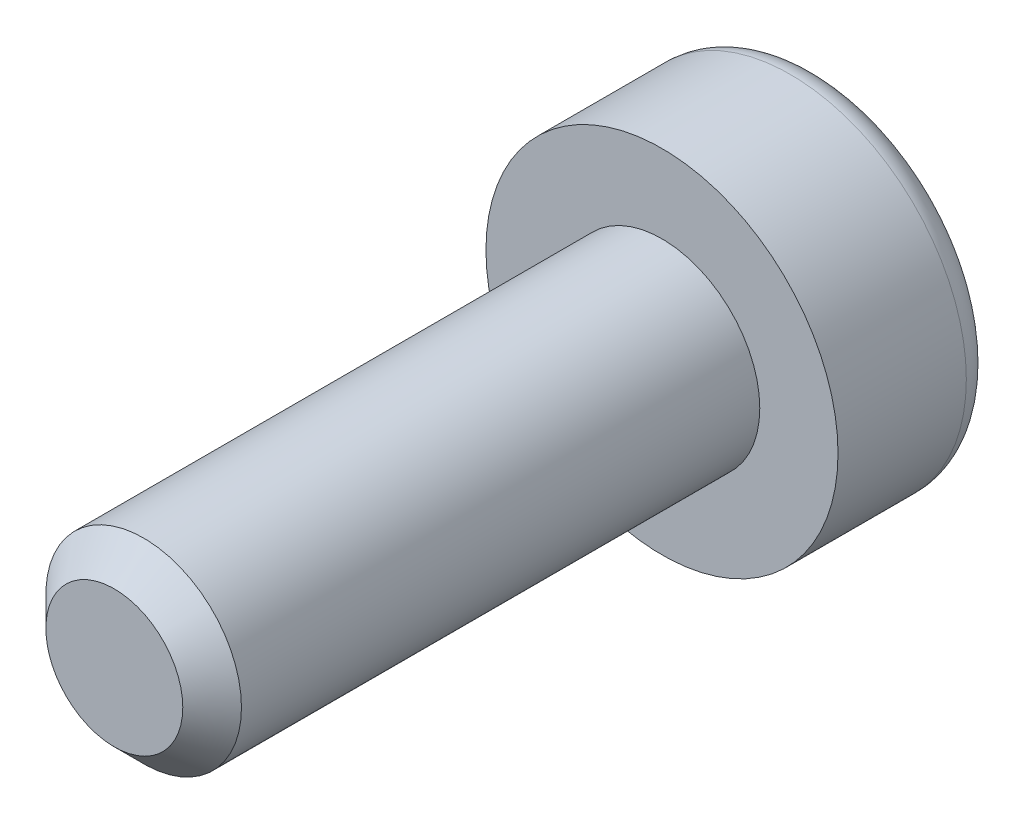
ISO-10303-21;
HEADER;
FILE_DESCRIPTION(('STEP AP214'),'2;1');
FILE_NAME('part.step','',(''),(''),'','','');
FILE_SCHEMA(('AUTOMOTIVE_DESIGN { 1 0 10303 214 1 1 1 1 }'));
ENDSEC;
DATA;
#1=APPLICATION_CONTEXT('core data for automotive mechanical design processes');
#2=APPLICATION_PROTOCOL_DEFINITION('international standard','automotive_design',2000,#1);
#3=PRODUCT_CONTEXT('',#1,'mechanical');
#4=PRODUCT('Part','Part','',(#3));
#5=PRODUCT_RELATED_PRODUCT_CATEGORY('part','',(#4));
#6=PRODUCT_DEFINITION_FORMATION('','',#4);
#7=PRODUCT_DEFINITION_CONTEXT('part definition',#1,'design');
#8=PRODUCT_DEFINITION('design','',#6,#7);
#9=PRODUCT_DEFINITION_SHAPE('','',#8);
#10=(LENGTH_UNIT() NAMED_UNIT(*) SI_UNIT(.MILLI.,.METRE.));
#11=(NAMED_UNIT(*) PLANE_ANGLE_UNIT() SI_UNIT($,.RADIAN.));
#12=(NAMED_UNIT(*) SI_UNIT($,.STERADIAN.) SOLID_ANGLE_UNIT());
#13=UNCERTAINTY_MEASURE_WITH_UNIT(LENGTH_MEASURE(1.E-05),#10,'distance_accuracy_value','');
#14=(GEOMETRIC_REPRESENTATION_CONTEXT(3) GLOBAL_UNCERTAINTY_ASSIGNED_CONTEXT((#13)) GLOBAL_UNIT_ASSIGNED_CONTEXT((#10,
#11,#12)) REPRESENTATION_CONTEXT('',''));
#15=CARTESIAN_POINT('',(0.,0.,0.));
#16=DIRECTION('',(0.,0.,1.));
#17=DIRECTION('',(1.,0.,0.));
#18=AXIS2_PLACEMENT_3D('',#15,#16,#17);
#19=CARTESIAN_POINT('',(0.,0.,-8.));
#20=DIRECTION('',(0.,0.,1.));
#21=DIRECTION('',(1.,0.,0.));
#22=AXIS2_PLACEMENT_3D('',#19,#20,#21);
#23=PLANE('',#22);
#24=CARTESIAN_POINT('',(0.,0.,-8.));
#25=DIRECTION('',(0.,0.,1.));
#26=DIRECTION('',(1.,0.,0.));
#27=AXIS2_PLACEMENT_3D('',#24,#25,#26);
#28=CIRCLE('',#27,7.56);
#29=CARTESIAN_POINT('',(7.56,0.,-8.));
#30=VERTEX_POINT('',#29);
#31=EDGE_CURVE('E11',#30,#30,#28,.F.);
#32=ORIENTED_EDGE('',*,*,#31,.T.);
#33=EDGE_LOOP('',(#32));
#34=FACE_BOUND('',#33,.T.);
#35=DIRECTION('',(0.866025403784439,-0.5,0.));
#36=VECTOR('',#35,1.);
#37=CARTESIAN_POINT('',(-3.,-1.73205080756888,-8.));
#38=LINE('',#37,#36);
#39=CARTESIAN_POINT('',(-3.,-1.73205080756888,-8.));
#40=VERTEX_POINT('',#39);
#41=CARTESIAN_POINT('',(0.,-3.46410161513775,-8.));
#42=VERTEX_POINT('',#41);
#43=EDGE_CURVE('E46',#40,#42,#38,.T.);
#44=ORIENTED_EDGE('',*,*,#43,.T.);
#45=DIRECTION('',(0.866025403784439,0.5,0.));
#46=VECTOR('',#45,1.);
#47=CARTESIAN_POINT('',(0.,-3.46410161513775,-8.));
#48=LINE('',#47,#46);
#49=CARTESIAN_POINT('',(3.,-1.73205080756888,-8.));
#50=VERTEX_POINT('',#49);
#51=EDGE_CURVE('E86',#42,#50,#48,.T.);
#52=ORIENTED_EDGE('',*,*,#51,.T.);
#53=DIRECTION('',(0.,1.,0.));
#54=VECTOR('',#53,1.);
#55=CARTESIAN_POINT('',(3.,-1.73205080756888,-8.));
#56=LINE('',#55,#54);
#57=CARTESIAN_POINT('',(3.,1.73205080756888,-8.));
#58=VERTEX_POINT('',#57);
#59=EDGE_CURVE('E94',#50,#58,#56,.T.);
#60=ORIENTED_EDGE('',*,*,#59,.T.);
#61=DIRECTION('',(-0.866025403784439,0.5,0.));
#62=VECTOR('',#61,1.);
#63=CARTESIAN_POINT('',(3.,1.73205080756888,-8.));
#64=LINE('',#63,#62);
#65=CARTESIAN_POINT('',(0.,3.46410161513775,-8.));
#66=VERTEX_POINT('',#65);
#67=EDGE_CURVE('E109',#58,#66,#64,.T.);
#68=ORIENTED_EDGE('',*,*,#67,.T.);
#69=DIRECTION('',(-0.866025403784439,-0.5,0.));
#70=VECTOR('',#69,1.);
#71=CARTESIAN_POINT('',(0.,3.46410161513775,-8.));
#72=LINE('',#71,#70);
#73=CARTESIAN_POINT('',(-3.,1.73205080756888,-8.));
#74=VERTEX_POINT('',#73);
#75=EDGE_CURVE('E112',#66,#74,#72,.T.);
#76=ORIENTED_EDGE('',*,*,#75,.T.);
#77=DIRECTION('',(0.,-1.,0.));
#78=VECTOR('',#77,1.);
#79=CARTESIAN_POINT('',(-3.,1.73205080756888,-8.));
#80=LINE('',#79,#78);
#81=EDGE_CURVE('E105',#74,#40,#80,.T.);
#82=ORIENTED_EDGE('',*,*,#81,.T.);
#83=EDGE_LOOP('',(#44,#52,#60,#68,#76,#82));
#84=FACE_BOUND('',#83,.T.);
#85=ADVANCED_FACE('F31',(#34,#84),#23,.F.);
#86=CARTESIAN_POINT('',(0.,0.,28.));
#87=DIRECTION('',(0.,0.,-1.));
#88=DIRECTION('',(-1.,0.,0.));
#89=AXIS2_PLACEMENT_3D('',#86,#87,#88);
#90=CYLINDRICAL_SURFACE('',#89,5.);
#91=CARTESIAN_POINT('',(0.,0.,26.5));
#92=DIRECTION('',(0.,0.,1.));
#93=DIRECTION('',(1.,0.,0.));
#94=AXIS2_PLACEMENT_3D('',#91,#92,#93);
#95=CIRCLE('',#94,5.);
#96=CARTESIAN_POINT('',(5.,0.,26.5));
#97=VERTEX_POINT('',#96);
#98=EDGE_CURVE('E142',#97,#97,#95,.F.);
#99=ORIENTED_EDGE('',*,*,#98,.T.);
#100=EDGE_LOOP('',(#99));
#101=FACE_BOUND('',#100,.T.);
#102=CARTESIAN_POINT('',(0.,0.,0.));
#103=DIRECTION('',(0.,0.,1.));
#104=DIRECTION('',(1.,0.,0.));
#105=AXIS2_PLACEMENT_3D('',#102,#103,#104);
#106=CIRCLE('',#105,5.);
#107=CARTESIAN_POINT('',(5.,0.,0.));
#108=VERTEX_POINT('',#107);
#109=EDGE_CURVE('E136',#108,#108,#106,.T.);
#110=ORIENTED_EDGE('',*,*,#109,.T.);
#111=EDGE_LOOP('',(#110));
#112=FACE_BOUND('',#111,.T.);
#113=ADVANCED_FACE('F33',(#101,#112),#90,.T.);
#114=CARTESIAN_POINT('',(0.,0.,28.));
#115=DIRECTION('',(0.,0.,1.));
#116=DIRECTION('',(1.,0.,0.));
#117=AXIS2_PLACEMENT_3D('',#114,#115,#116);
#118=PLANE('',#117);
#119=CARTESIAN_POINT('',(0.,0.,28.));
#120=DIRECTION('',(0.,0.,1.));
#121=DIRECTION('',(1.,0.,0.));
#122=AXIS2_PLACEMENT_3D('',#119,#120,#121);
#123=CIRCLE('',#122,3.5);
#124=CARTESIAN_POINT('',(3.5,0.,28.));
#125=VERTEX_POINT('',#124);
#126=EDGE_CURVE('E139',#125,#125,#123,.T.);
#127=ORIENTED_EDGE('',*,*,#126,.T.);
#128=EDGE_LOOP('',(#127));
#129=FACE_BOUND('',#128,.T.);
#130=ADVANCED_FACE('F168',(#129),#118,.T.);
#131=CARTESIAN_POINT('',(0.,0.,0.));
#132=DIRECTION('',(0.,0.,1.));
#133=DIRECTION('',(1.,0.,0.));
#134=AXIS2_PLACEMENT_3D('',#131,#132,#133);
#135=PLANE('',#134);
#136=CARTESIAN_POINT('',(0.,0.,0.));
#137=DIRECTION('',(0.,0.,1.));
#138=DIRECTION('',(1.,0.,0.));
#139=AXIS2_PLACEMENT_3D('',#136,#137,#138);
#140=CIRCLE('',#139,9.);
#141=CARTESIAN_POINT('',(9.,0.,0.));
#142=VERTEX_POINT('',#141);
#143=EDGE_CURVE('E100',#142,#142,#140,.T.);
#144=ORIENTED_EDGE('',*,*,#143,.T.);
#145=EDGE_LOOP('',(#144));
#146=FACE_BOUND('',#145,.T.);
#147=ORIENTED_EDGE('',*,*,#109,.F.);
#148=EDGE_LOOP('',(#147));
#149=FACE_BOUND('',#148,.T.);
#150=ADVANCED_FACE('F172',(#146,#149),#135,.T.);
#151=CARTESIAN_POINT('',(0.,0.,-8.));
#152=DIRECTION('',(0.,0.,1.));
#153=DIRECTION('',(1.,0.,0.));
#154=AXIS2_PLACEMENT_3D('',#151,#152,#153);
#155=CYLINDRICAL_SURFACE('',#154,9.);
#156=CARTESIAN_POINT('',(0.,0.,-6.56));
#157=DIRECTION('',(0.,0.,1.));
#158=DIRECTION('',(1.,0.,0.));
#159=AXIS2_PLACEMENT_3D('',#156,#157,#158);
#160=CIRCLE('',#159,9.);
#161=CARTESIAN_POINT('',(9.,0.,-6.56));
#162=VERTEX_POINT('',#161);
#163=EDGE_CURVE('E39',#162,#162,#160,.T.);
#164=ORIENTED_EDGE('',*,*,#163,.T.);
#165=EDGE_LOOP('',(#164));
#166=FACE_BOUND('',#165,.T.);
#167=ORIENTED_EDGE('',*,*,#143,.F.);
#168=EDGE_LOOP('',(#167));
#169=FACE_BOUND('',#168,.T.);
#170=ADVANCED_FACE('F147',(#166,#169),#155,.T.);
#171=CARTESIAN_POINT('',(-3.,-1.73205080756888,-2.4));
#172=DIRECTION('',(0.5,0.866025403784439,0.));
#173=DIRECTION('',(-0.866025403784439,0.5,0.));
#174=AXIS2_PLACEMENT_3D('',#171,#172,#173);
#175=PLANE('',#174);
#176=ORIENTED_EDGE('',*,*,#43,.F.);
#177=DIRECTION('',(0.,0.,-1.));
#178=VECTOR('',#177,1.);
#179=CARTESIAN_POINT('',(-3.,-1.73205080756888,-2.4));
#180=LINE('',#179,#178);
#181=CARTESIAN_POINT('',(-3.,-1.73205080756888,-2.4));
#182=VERTEX_POINT('',#181);
#183=EDGE_CURVE('E125',#182,#40,#180,.T.);
#184=ORIENTED_EDGE('',*,*,#183,.F.);
#185=DIRECTION('',(0.866025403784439,-0.5,0.));
#186=VECTOR('',#185,1.);
#187=CARTESIAN_POINT('',(-3.,-1.73205080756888,-2.4));
#188=LINE('',#187,#186);
#189=CARTESIAN_POINT('',(0.,-3.46410161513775,-2.4));
#190=VERTEX_POINT('',#189);
#191=EDGE_CURVE('E99',#182,#190,#188,.T.);
#192=ORIENTED_EDGE('',*,*,#191,.T.);
#193=DIRECTION('',(0.,0.,-1.));
#194=VECTOR('',#193,1.);
#195=CARTESIAN_POINT('',(0.,-3.46410161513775,-2.4));
#196=LINE('',#195,#194);
#197=EDGE_CURVE('E88',#190,#42,#196,.T.);
#198=ORIENTED_EDGE('',*,*,#197,.T.);
#199=EDGE_LOOP('',(#176,#184,#192,#198));
#200=FACE_BOUND('',#199,.T.);
#201=ADVANCED_FACE('F97',(#200),#175,.T.);
#202=CARTESIAN_POINT('',(0.,-3.46410161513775,-2.4));
#203=DIRECTION('',(-0.5,0.866025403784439,0.));
#204=DIRECTION('',(-0.866025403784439,-0.5,0.));
#205=AXIS2_PLACEMENT_3D('',#202,#203,#204);
#206=PLANE('',#205);
#207=ORIENTED_EDGE('',*,*,#51,.F.);
#208=ORIENTED_EDGE('',*,*,#197,.F.);
#209=DIRECTION('',(0.866025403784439,0.5,0.));
#210=VECTOR('',#209,1.);
#211=CARTESIAN_POINT('',(0.,-3.46410161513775,-2.4));
#212=LINE('',#211,#210);
#213=CARTESIAN_POINT('',(3.,-1.73205080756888,-2.4));
#214=VERTEX_POINT('',#213);
#215=EDGE_CURVE('E116',#190,#214,#212,.T.);
#216=ORIENTED_EDGE('',*,*,#215,.T.);
#217=DIRECTION('',(0.,0.,-1.));
#218=VECTOR('',#217,1.);
#219=CARTESIAN_POINT('',(3.,-1.73205080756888,-2.4));
#220=LINE('',#219,#218);
#221=EDGE_CURVE('E90',#214,#50,#220,.T.);
#222=ORIENTED_EDGE('',*,*,#221,.T.);
#223=EDGE_LOOP('',(#207,#208,#216,#222));
#224=FACE_BOUND('',#223,.T.);
#225=ADVANCED_FACE('F87',(#224),#206,.T.);
#226=CARTESIAN_POINT('',(3.,-1.73205080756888,-2.4));
#227=DIRECTION('',(-1.,0.,0.));
#228=DIRECTION('',(0.,0.,1.));
#229=AXIS2_PLACEMENT_3D('',#226,#227,#228);
#230=PLANE('',#229);
#231=ORIENTED_EDGE('',*,*,#59,.F.);
#232=ORIENTED_EDGE('',*,*,#221,.F.);
#233=DIRECTION('',(0.,1.,0.));
#234=VECTOR('',#233,1.);
#235=CARTESIAN_POINT('',(3.,-1.73205080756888,-2.4));
#236=LINE('',#235,#234);
#237=CARTESIAN_POINT('',(3.,1.73205080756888,-2.4));
#238=VERTEX_POINT('',#237);
#239=EDGE_CURVE('E118',#214,#238,#236,.T.);
#240=ORIENTED_EDGE('',*,*,#239,.T.);
#241=DIRECTION('',(0.,0.,-1.));
#242=VECTOR('',#241,1.);
#243=CARTESIAN_POINT('',(3.,1.73205080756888,-2.4));
#244=LINE('',#243,#242);
#245=EDGE_CURVE('E131',#238,#58,#244,.T.);
#246=ORIENTED_EDGE('',*,*,#245,.T.);
#247=EDGE_LOOP('',(#231,#232,#240,#246));
#248=FACE_BOUND('',#247,.T.);
#249=ADVANCED_FACE('F204',(#248),#230,.T.);
#250=CARTESIAN_POINT('',(3.,1.73205080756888,-2.4));
#251=DIRECTION('',(-0.5,-0.866025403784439,0.));
#252=DIRECTION('',(0.866025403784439,-0.5,0.));
#253=AXIS2_PLACEMENT_3D('',#250,#251,#252);
#254=PLANE('',#253);
#255=ORIENTED_EDGE('',*,*,#67,.F.);
#256=ORIENTED_EDGE('',*,*,#245,.F.);
#257=DIRECTION('',(-0.866025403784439,0.5,0.));
#258=VECTOR('',#257,1.);
#259=CARTESIAN_POINT('',(3.,1.73205080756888,-2.4));
#260=LINE('',#259,#258);
#261=CARTESIAN_POINT('',(0.,3.46410161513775,-2.4));
#262=VERTEX_POINT('',#261);
#263=EDGE_CURVE('E120',#238,#262,#260,.T.);
#264=ORIENTED_EDGE('',*,*,#263,.T.);
#265=DIRECTION('',(0.,0.,-1.));
#266=VECTOR('',#265,1.);
#267=CARTESIAN_POINT('',(0.,3.46410161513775,-2.4));
#268=LINE('',#267,#266);
#269=EDGE_CURVE('E129',#262,#66,#268,.T.);
#270=ORIENTED_EDGE('',*,*,#269,.T.);
#271=EDGE_LOOP('',(#255,#256,#264,#270));
#272=FACE_BOUND('',#271,.T.);
#273=ADVANCED_FACE('F211',(#272),#254,.T.);
#274=CARTESIAN_POINT('',(0.,3.46410161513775,-2.4));
#275=DIRECTION('',(0.5,-0.866025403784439,0.));
#276=DIRECTION('',(0.866025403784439,0.5,0.));
#277=AXIS2_PLACEMENT_3D('',#274,#275,#276);
#278=PLANE('',#277);
#279=ORIENTED_EDGE('',*,*,#75,.F.);
#280=ORIENTED_EDGE('',*,*,#269,.F.);
#281=DIRECTION('',(-0.866025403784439,-0.5,0.));
#282=VECTOR('',#281,1.);
#283=CARTESIAN_POINT('',(0.,3.46410161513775,-2.4));
#284=LINE('',#283,#282);
#285=CARTESIAN_POINT('',(-3.,1.73205080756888,-2.4));
#286=VERTEX_POINT('',#285);
#287=EDGE_CURVE('E122',#262,#286,#284,.T.);
#288=ORIENTED_EDGE('',*,*,#287,.T.);
#289=DIRECTION('',(0.,0.,-1.));
#290=VECTOR('',#289,1.);
#291=CARTESIAN_POINT('',(-3.,1.73205080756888,-2.4));
#292=LINE('',#291,#290);
#293=EDGE_CURVE('E127',#286,#74,#292,.T.);
#294=ORIENTED_EDGE('',*,*,#293,.T.);
#295=EDGE_LOOP('',(#279,#280,#288,#294));
#296=FACE_BOUND('',#295,.T.);
#297=ADVANCED_FACE('F219',(#296),#278,.T.);
#298=CARTESIAN_POINT('',(-3.,1.73205080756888,-2.4));
#299=DIRECTION('',(1.,0.,0.));
#300=DIRECTION('',(0.,1.,0.));
#301=AXIS2_PLACEMENT_3D('',#298,#299,#300);
#302=PLANE('',#301);
#303=ORIENTED_EDGE('',*,*,#81,.F.);
#304=ORIENTED_EDGE('',*,*,#293,.F.);
#305=DIRECTION('',(0.,-1.,0.));
#306=VECTOR('',#305,1.);
#307=CARTESIAN_POINT('',(-3.,1.73205080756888,-2.4));
#308=LINE('',#307,#306);
#309=EDGE_CURVE('E53',#286,#182,#308,.T.);
#310=ORIENTED_EDGE('',*,*,#309,.T.);
#311=ORIENTED_EDGE('',*,*,#183,.T.);
#312=EDGE_LOOP('',(#303,#304,#310,#311));
#313=FACE_BOUND('',#312,.T.);
#314=ADVANCED_FACE('F227',(#313),#302,.T.);
#315=CARTESIAN_POINT('',(-3.,-1.73205080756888,-2.4));
#316=DIRECTION('',(0.,0.,-1.));
#317=DIRECTION('',(-1.,0.,0.));
#318=AXIS2_PLACEMENT_3D('',#315,#316,#317);
#319=PLANE('',#318);
#320=ORIENTED_EDGE('',*,*,#191,.F.);
#321=ORIENTED_EDGE('',*,*,#309,.F.);
#322=ORIENTED_EDGE('',*,*,#287,.F.);
#323=ORIENTED_EDGE('',*,*,#263,.F.);
#324=ORIENTED_EDGE('',*,*,#239,.F.);
#325=ORIENTED_EDGE('',*,*,#215,.F.);
#326=EDGE_LOOP('',(#320,#321,#322,#323,#324,#325));
#327=FACE_BOUND('',#326,.T.);
#328=ADVANCED_FACE('F158',(#327),#319,.T.);
#329=CARTESIAN_POINT('',(0.,0.,28.));
#330=DIRECTION('',(0.,0.,-1.));
#331=DIRECTION('',(-1.,0.,0.));
#332=AXIS2_PLACEMENT_3D('',#329,#330,#331);
#333=CONICAL_SURFACE('',#332,3.5,0.785398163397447);
#334=ORIENTED_EDGE('',*,*,#98,.F.);
#335=EDGE_LOOP('',(#334));
#336=FACE_BOUND('',#335,.T.);
#337=ORIENTED_EDGE('',*,*,#126,.F.);
#338=EDGE_LOOP('',(#337));
#339=FACE_BOUND('',#338,.T.);
#340=ADVANCED_FACE('F152',(#336,#339),#333,.T.);
#341=CARTESIAN_POINT('',(0.,0.,-6.56));
#342=DIRECTION('',(0.,0.,1.));
#343=DIRECTION('',(1.,0.,0.));
#344=AXIS2_PLACEMENT_3D('',#341,#342,#343);
#345=TOROIDAL_SURFACE('',#344,7.56,1.44);
#346=ORIENTED_EDGE('',*,*,#31,.F.);
#347=EDGE_LOOP('',(#346));
#348=FACE_BOUND('',#347,.T.);
#349=ORIENTED_EDGE('',*,*,#163,.F.);
#350=EDGE_LOOP('',(#349));
#351=FACE_BOUND('',#350,.T.);
#352=ADVANCED_FACE('F150',(#348,#351),#345,.T.);
#353=CLOSED_SHELL('',(#85,#113,#130,#150,#170,#201,#225,#249,#273,#297,#314,#328,#340,#352));
#354=MANIFOLD_SOLID_BREP('B2',#353);
#355=ADVANCED_BREP_SHAPE_REPRESENTATION('',(#18,#354),#14);
#356=SHAPE_DEFINITION_REPRESENTATION(#9,#355);
ENDSEC;
END-ISO-10303-21;
